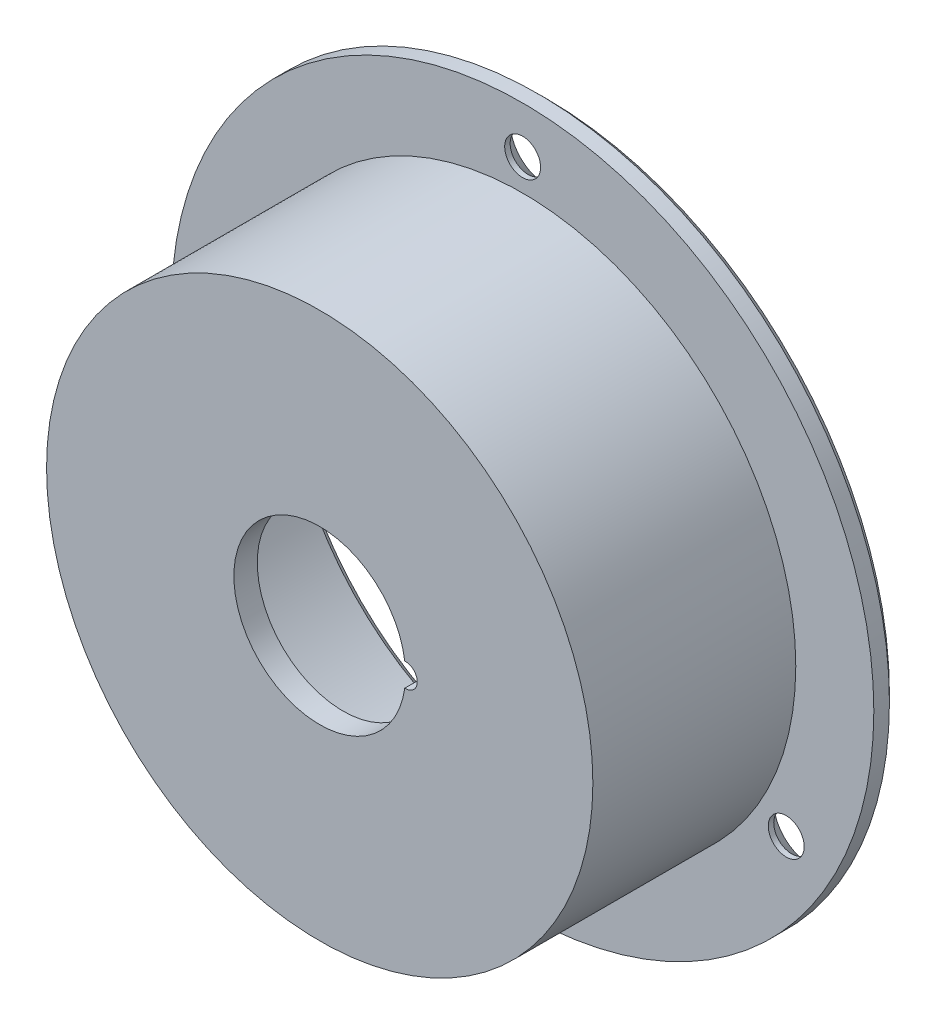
from build123d import *

# Parameters (mm, degrees)
SZKIC1_R                         = 45
SZKIC1_R_2                       = 35
DODANIE_WYCI_GNI_CIE1_DEPTH      = 3
SZKIC2_R                         = 35
SZKIC2_R_2                       = 32.5
DODANIE_WYCI_GNI_CIE2_DEPTH      = 23
SZKIC3_R                         = 35
DODANIE_WYCI_GNI_CIE3_DEPTH      = 3
SZKIC4_R                         = 11
WYTNIJ_WYCI_GNI_CIE1_DEPTH       = 3
DODANIE_WYCI_GNI_CIE4_START      = 3
SZKIC5_R                         = 35
DODANIE_WYCI_GNI_CIE4_DEPTH      = 3
WYTNIJ_WYCI_GNI_CIE2_START       = -3
SZKIC6_R                         = 32.5
WYTNIJ_WYCI_GNI_CIE2_DEPTH       = 3
SFAZOWANIE1_SIZE                 = 1
SZKIC7_R                         = 2.3
WYTNIJ_WYCI_GNI_CIE3_DEPTH       = 10
SFAZOWANIE2_SIZE                 = 2.3
SZYK_KO_OWY1_COUNT               = 3
SFAZOWANIE2_OF_SZYK_KO_OWY1_SIZE = 2.3
SZKIC8_R                         = 1.5
WYTNIJ_WYCI_GNI_CIE4_DEPTH       = 10


with BuildPart() as part:
    # Szkic1 → Dodanie-wyci_gni_cie1 (new body)
    with BuildSketch(Plane.XY):
        Circle(SZKIC1_R)
        Circle(SZKIC1_R_2, mode=Mode.SUBTRACT)
    extrude(amount=DODANIE_WYCI_GNI_CIE1_DEPTH)



with BuildPart() as body_2:
    # Szkic2 → Dodanie-wyci_gni_cie2 (new body)
    with BuildSketch(Plane.XY.offset(3)):
        Circle(SZKIC2_R)
        Circle(SZKIC2_R_2, mode=Mode.SUBTRACT)
    extrude(amount=DODANIE_WYCI_GNI_CIE2_DEPTH)

    # Szkic3 → Dodanie-wyci_gni_cie3 (add)
    with BuildSketch(Plane.XY.offset(26)):
        Circle(SZKIC3_R)
    extrude(amount=DODANIE_WYCI_GNI_CIE3_DEPTH)

    # Szkic4 → Wytnij-wyci_gni_cie1 (cut)
    with BuildSketch(Plane.XY.offset(29)):
        Circle(SZKIC4_R)
    extrude(amount=-WYTNIJ_WYCI_GNI_CIE1_DEPTH, mode=Mode.SUBTRACT)


with BuildPart() as part_1:
    add(part.part)

    add(body_2.part)  # Dodanie-wyci_gni_cie4 merges body 2
    # Szkic5 → Dodanie-wyci_gni_cie4 (add)
    with BuildSketch(Plane(origin=(0, 0, 3), x_dir=(-1, 0, 0), z_dir=(0, 0, -1)).offset(DODANIE_WYCI_GNI_CIE4_START)):
        with Locations(Location((0, 0, 0), (0, 0, 180))):
            Circle(SZKIC5_R)
    extrude(amount=-DODANIE_WYCI_GNI_CIE4_DEPTH)

    # Szkic6 → Wytnij-wyci_gni_cie2 (cut)
    with BuildSketch(Plane.XY.offset(3).offset(WYTNIJ_WYCI_GNI_CIE2_START)):
        Circle(SZKIC6_R)
    extrude(amount=WYTNIJ_WYCI_GNI_CIE2_DEPTH, mode=Mode.SUBTRACT)

    # Sfazowanie1
    sfazowanie1_edges = [part_1.edges().sort_by_distance(p)[0] for p in [
        (-45, 0, 0),
        (-32.5, 0, 0),
    ]]
    chamfer(sfazowanie1_edges, length=SFAZOWANIE1_SIZE)

    # Szkic7 → Wytnij-wyci_gni_cie3 (cut)
    with BuildSketch(Plane.XY.offset(3)):
        with Locations((0, 39)):
            Circle(SZKIC7_R)
    wytnij_wyci_gni_cie3 = extrude(amount=-WYTNIJ_WYCI_GNI_CIE3_DEPTH, mode=Mode.SUBTRACT)

    # Sfazowanie2
    sfazowanie2_edges = [part_1.edges().sort_by_distance(p)[0] for p in [
        (-2.3, 39, 0),
    ]]
    chamfer(sfazowanie2_edges, length=SFAZOWANIE2_SIZE)

    # Szyk ko_owy1: Wytnij-wyci_gni_cie3 ×3 about axis
    szyk_ko_owy1_axis = Axis((0, 0, 0), (0, 0, 1))
    for i in range(1, SZYK_KO_OWY1_COUNT):
        add(wytnij_wyci_gni_cie3.rotate(szyk_ko_owy1_axis, i * 360 / SZYK_KO_OWY1_COUNT), mode=Mode.SUBTRACT)

    # Sfazowanie2 of Szyk ko_owy1
    sfazowanie2_of_szyk_ko_owy1_edges = [part_1.edges().sort_by_distance(p)[0] for p in [
        (-32.624990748, -21.491858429, 0),
        (34.924990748, -17.508141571, 0),
    ]]
    chamfer(sfazowanie2_of_szyk_ko_owy1_edges, length=SFAZOWANIE2_OF_SZYK_KO_OWY1_SIZE)

    # Szkic8 → Wytnij-wyci_gni_cie4 (cut)
    with BuildSketch(Plane(origin=(0, 0, 26), x_dir=(-1, 0, 0), z_dir=(0, 0, -1))):
        with Locations((-11, 0)):
            Circle(SZKIC8_R)
    extrude(amount=-WYTNIJ_WYCI_GNI_CIE4_DEPTH, mode=Mode.SUBTRACT)


solid = part_1.part
